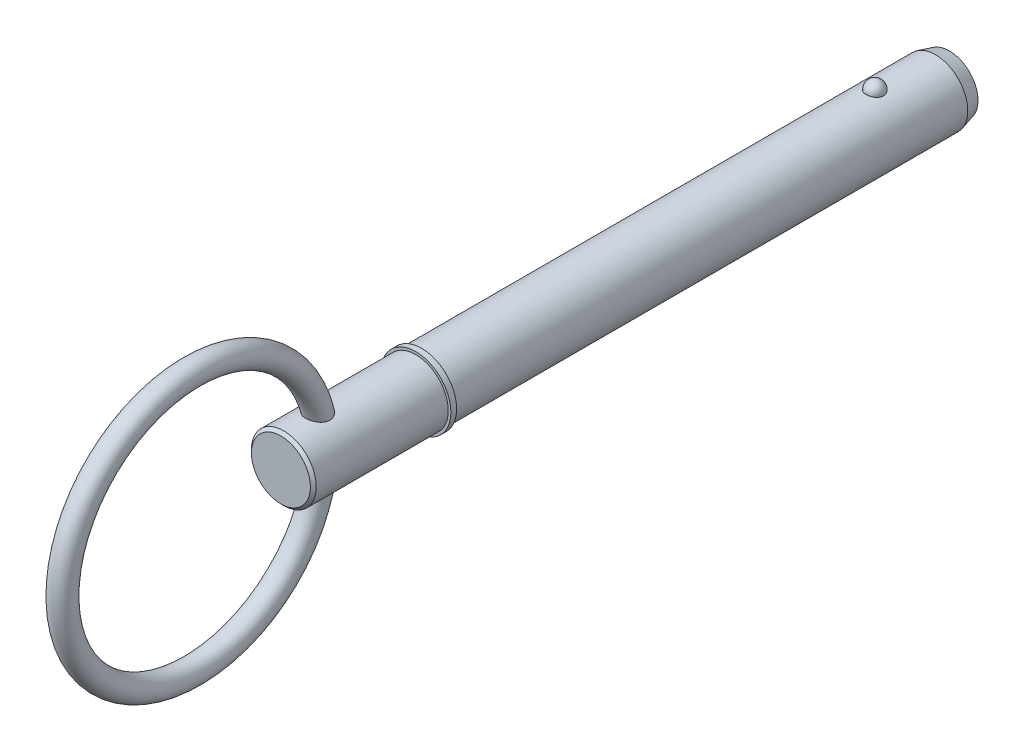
ISO-10303-21;
HEADER;
FILE_DESCRIPTION(('STEP AP214'),'2;1');
FILE_NAME('part.step','',(''),(''),'','','');
FILE_SCHEMA(('AUTOMOTIVE_DESIGN { 1 0 10303 214 1 1 1 1 }'));
ENDSEC;
DATA;
#1=APPLICATION_CONTEXT('core data for automotive mechanical design processes');
#2=APPLICATION_PROTOCOL_DEFINITION('international standard','automotive_design',2000,#1);
#3=PRODUCT_CONTEXT('',#1,'mechanical');
#4=PRODUCT('Part','Part','',(#3));
#5=PRODUCT_RELATED_PRODUCT_CATEGORY('part','',(#4));
#6=PRODUCT_DEFINITION_FORMATION('','',#4);
#7=PRODUCT_DEFINITION_CONTEXT('part definition',#1,'design');
#8=PRODUCT_DEFINITION('design','',#6,#7);
#9=PRODUCT_DEFINITION_SHAPE('','',#8);
#10=(LENGTH_UNIT() NAMED_UNIT(*) SI_UNIT(.MILLI.,.METRE.));
#11=(NAMED_UNIT(*) PLANE_ANGLE_UNIT() SI_UNIT($,.RADIAN.));
#12=(NAMED_UNIT(*) SI_UNIT($,.STERADIAN.) SOLID_ANGLE_UNIT());
#13=UNCERTAINTY_MEASURE_WITH_UNIT(LENGTH_MEASURE(1.E-05),#10,'distance_accuracy_value','');
#14=(GEOMETRIC_REPRESENTATION_CONTEXT(3) GLOBAL_UNCERTAINTY_ASSIGNED_CONTEXT((#13)) GLOBAL_UNIT_ASSIGNED_CONTEXT((#10,
#11,#12)) REPRESENTATION_CONTEXT('',''));
#15=CARTESIAN_POINT('',(0.,0.,0.));
#16=DIRECTION('',(0.,0.,1.));
#17=DIRECTION('',(1.,0.,0.));
#18=AXIS2_PLACEMENT_3D('',#15,#16,#17);
#19=CARTESIAN_POINT('',(0.,0.,76.2));
#20=DIRECTION('',(0.,0.,-1.));
#21=DIRECTION('',(-1.,0.,0.));
#22=AXIS2_PLACEMENT_3D('',#19,#20,#21);
#23=CYLINDRICAL_SURFACE('',#22,5.555);
#24=CARTESIAN_POINT('',(1.47653932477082,5.35517101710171,-1.49));
#25=CARTESIAN_POINT('',(1.4765376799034,5.35517235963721,-1.40667872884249));
#26=CARTESIAN_POINT('',(1.4697233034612,5.35706459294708,-1.32333626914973));
#27=CARTESIAN_POINT('',(1.4426291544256,5.36442332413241,-1.15900769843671));
#28=CARTESIAN_POINT('',(1.42234344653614,5.36989139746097,-1.07802264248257));
#29=CARTESIAN_POINT('',(1.36882802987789,5.38378061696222,-0.920757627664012));
#30=CARTESIAN_POINT('',(1.33560404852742,5.39220045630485,-0.844475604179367));
#31=CARTESIAN_POINT('',(1.25704906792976,5.41105136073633,-0.698703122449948));
#32=CARTESIAN_POINT('',(1.21171855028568,5.42148234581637,-0.629212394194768));
#33=CARTESIAN_POINT('',(1.10986325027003,5.44324765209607,-0.498626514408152));
#34=CARTESIAN_POINT('',(1.05328868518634,5.45458585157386,-0.437570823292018));
#35=CARTESIAN_POINT('',(0.930545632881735,5.4768596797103,-0.325918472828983));
#36=CARTESIAN_POINT('',(0.864377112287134,5.48779530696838,-0.27532184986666));
#37=CARTESIAN_POINT('',(0.72441282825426,5.50801510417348,-0.186125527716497));
#38=CARTESIAN_POINT('',(0.650637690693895,5.51730356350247,-0.147494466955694));
#39=CARTESIAN_POINT('',(0.497383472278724,5.53322345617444,-0.0831582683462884));
#40=CARTESIAN_POINT('',(0.417904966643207,5.53985515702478,-0.0574518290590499));
#41=CARTESIAN_POINT('',(0.256903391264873,5.54963245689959,-0.0200294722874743));
#42=CARTESIAN_POINT('',(0.175435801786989,5.55283384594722,-0.00808940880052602));
#43=CARTESIAN_POINT('',(0.0115885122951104,5.55559187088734,0.00221439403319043));
#44=CARTESIAN_POINT('',(-0.0707911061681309,5.55514883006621,0.000579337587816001));
#45=CARTESIAN_POINT('',(-0.232980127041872,5.55069756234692,-0.0161051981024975));
#46=CARTESIAN_POINT('',(-0.312809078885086,5.54673626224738,-0.0309781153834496));
#47=CARTESIAN_POINT('',(-0.468771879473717,5.5357377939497,-0.0734743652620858));
#48=CARTESIAN_POINT('',(-0.544905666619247,5.52870057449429,-0.101097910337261));
#49=CARTESIAN_POINT('',(-0.691800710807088,5.51225307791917,-0.168516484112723));
#50=CARTESIAN_POINT('',(-0.762530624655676,5.50283015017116,-0.208376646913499));
#51=CARTESIAN_POINT('',(-0.896294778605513,5.48263289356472,-0.299136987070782));
#52=CARTESIAN_POINT('',(-0.959328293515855,5.47185843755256,-0.350038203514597));
#53=CARTESIAN_POINT('',(-1.0771278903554,5.44990641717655,-0.462517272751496));
#54=CARTESIAN_POINT('',(-1.13172901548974,5.43872509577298,-0.524267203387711));
#55=CARTESIAN_POINT('',(-1.2299173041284,5.41736658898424,-0.656133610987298));
#56=CARTESIAN_POINT('',(-1.2735037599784,5.40718946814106,-0.726250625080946));
#57=CARTESIAN_POINT('',(-1.34896420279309,5.38886361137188,-0.873713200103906));
#58=CARTESIAN_POINT('',(-1.38071142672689,5.38073711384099,-0.951126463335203));
#59=CARTESIAN_POINT('',(-1.4310375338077,5.36757288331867,-1.11037033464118));
#60=CARTESIAN_POINT('',(-1.44961676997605,5.3625350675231,-1.19220082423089));
#61=CARTESIAN_POINT('',(-1.47308754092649,5.35613553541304,-1.35761209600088));
#62=CARTESIAN_POINT('',(-1.47803294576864,5.35475935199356,-1.44118467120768));
#63=CARTESIAN_POINT('',(-1.47426441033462,5.35579807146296,-1.6079958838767));
#64=CARTESIAN_POINT('',(-1.46555080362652,5.35821288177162,-1.69123452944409));
#65=CARTESIAN_POINT('',(-1.43475662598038,5.36653964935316,-1.8546288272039));
#66=CARTESIAN_POINT('',(-1.41273621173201,5.37243586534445,-1.93479663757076));
#67=CARTESIAN_POINT('',(-1.35593151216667,5.38705199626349,-2.0902011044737));
#68=CARTESIAN_POINT('',(-1.32114675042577,5.39577201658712,-2.16543757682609));
#69=CARTESIAN_POINT('',(-1.23947506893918,5.41511674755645,-2.30926926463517));
#70=CARTESIAN_POINT('',(-1.1925277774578,5.42575087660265,-2.37782893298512));
#71=CARTESIAN_POINT('',(-1.08780725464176,5.44771095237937,-2.50598876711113));
#72=CARTESIAN_POINT('',(-1.03003365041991,5.45903692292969,-2.56558862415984));
#73=CARTESIAN_POINT('',(-0.904953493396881,5.48116073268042,-2.67436535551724));
#74=CARTESIAN_POINT('',(-0.837616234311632,5.49195671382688,-2.7235073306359));
#75=CARTESIAN_POINT('',(-0.695379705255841,5.51177099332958,-2.8097317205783));
#76=CARTESIAN_POINT('',(-0.620480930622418,5.52078940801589,-2.84681492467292));
#77=CARTESIAN_POINT('',(-0.466144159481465,5.53594369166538,-2.90749751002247));
#78=CARTESIAN_POINT('',(-0.386768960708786,5.54211181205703,-2.93124844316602));
#79=CARTESIAN_POINT('',(-0.224991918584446,5.5510324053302,-2.96523308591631));
#80=CARTESIAN_POINT('',(-0.142590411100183,5.55378525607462,-2.97546829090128));
#81=CARTESIAN_POINT('',(0.0213711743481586,5.55555351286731,-2.98206550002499));
#82=CARTESIAN_POINT('',(0.102921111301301,5.55463281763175,-2.97866468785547));
#83=CARTESIAN_POINT('',(0.2642564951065,5.54929804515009,-2.95862186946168));
#84=CARTESIAN_POINT('',(0.344041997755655,5.54488407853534,-2.94198028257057));
#85=CARTESIAN_POINT('',(0.499344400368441,5.53305794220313,-2.89600357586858));
#86=CARTESIAN_POINT('',(0.57487425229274,5.52565550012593,-2.86670961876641));
#87=CARTESIAN_POINT('',(0.71989857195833,5.50863937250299,-2.79624249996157));
#88=CARTESIAN_POINT('',(0.78939269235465,5.49902555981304,-2.75506865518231));
#89=CARTESIAN_POINT('',(0.921480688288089,5.47845199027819,-2.66127110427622));
#90=CARTESIAN_POINT('',(0.983960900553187,5.46747485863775,-2.60849118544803));
#91=CARTESIAN_POINT('',(1.09925057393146,5.44546837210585,-2.49325304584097));
#92=CARTESIAN_POINT('',(1.15205830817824,5.43443900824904,-2.43079310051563));
#93=CARTESIAN_POINT('',(1.24742943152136,5.41335152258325,-2.29680711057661));
#94=CARTESIAN_POINT('',(1.28981661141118,5.40331162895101,-2.22515272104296));
#95=CARTESIAN_POINT('',(1.36214937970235,5.38553336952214,-2.07558035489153));
#96=CARTESIAN_POINT('',(1.39210034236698,5.37779400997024,-1.99766510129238));
#97=CARTESIAN_POINT('',(1.43569518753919,5.36630594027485,-1.84848338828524));
#98=CARTESIAN_POINT('',(1.45098536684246,5.36216169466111,-1.77772322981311));
#99=CARTESIAN_POINT('',(1.47140805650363,5.35659367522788,-1.63464735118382));
#100=CARTESIAN_POINT('',(1.47654075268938,5.35516985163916,-1.56233165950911));
#101=CARTESIAN_POINT('',(1.47653932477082,5.35517101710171,-1.49));
#102=B_SPLINE_CURVE_WITH_KNOTS('',3,(#24,#25,#26,#27,#28,#29,#30,#31,#32,#33,#34,#35,#36,#37,
#38,#39,#40,#41,#42,#43,#44,#45,#46,#47,#48,#49,#50,#51,#52,#53,#54,#55,#56,#57,#58,#59,#60,#61,
#62,#63,#64,#65,#66,#67,#68,#69,#70,#71,#72,#73,#74,#75,#76,#77,#78,#79,#80,#81,#82,#83,#84,#85,
#86,#87,#88,#89,#90,#91,#92,#93,#94,#95,#96,#97,#98,#99,#100,#101),.UNSPECIFIED.,.T.,.F.,(4,2,2,
2,2,2,2,2,2,2,2,2,2,2,2,2,2,2,2,2,2,2,2,2,2,2,2,2,2,2,2,2,2,2,2,2,2,2,4),(0.,0.249703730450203,
0.4995175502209,0.749220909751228,0.998914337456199,1.24973894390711,1.50056442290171,
1.75072681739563,2.00086401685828,2.24686822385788,2.49285060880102,2.73560052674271,
2.97835449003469,3.22242369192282,3.46651587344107,3.71490232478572,3.96330473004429,
4.21429522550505,4.46527899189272,4.71526963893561,4.96525418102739,5.21411697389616,
5.46298905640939,5.71312097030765,5.96326150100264,6.21422412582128,6.46517032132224,
6.71320296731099,6.96120816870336,7.20491846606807,7.44862104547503,7.69153667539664,
7.93446627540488,8.18089104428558,8.42735976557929,8.67774679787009,8.92802551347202,
9.14479867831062,9.36156787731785),.UNSPECIFIED.);
#103=CARTESIAN_POINT('',(1.47653932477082,5.35517101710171,-1.49));
#104=VERTEX_POINT('',#103);
#105=EDGE_CURVE('E100',#104,#104,#102,.T.);
#106=ORIENTED_EDGE('',*,*,#105,.T.);
#107=EDGE_LOOP('',(#106));
#108=FACE_BOUND('',#107,.T.);
#109=CARTESIAN_POINT('',(0.,0.,-11.87));
#110=DIRECTION('',(0.,0.,-1.));
#111=DIRECTION('',(-1.,0.,0.));
#112=AXIS2_PLACEMENT_3D('',#109,#110,#111);
#113=CIRCLE('',#112,5.555);
#114=CARTESIAN_POINT('',(-5.555,0.,-11.87));
#115=VERTEX_POINT('',#114);
#116=EDGE_CURVE('E107',#115,#115,#113,.F.);
#117=ORIENTED_EDGE('',*,*,#116,.T.);
#118=EDGE_LOOP('',(#117));
#119=FACE_BOUND('',#118,.T.);
#120=CARTESIAN_POINT('',(0.,0.,76.2));
#121=DIRECTION('',(0.,0.,1.));
#122=DIRECTION('',(1.,0.,0.));
#123=AXIS2_PLACEMENT_3D('',#120,#121,#122);
#124=CIRCLE('',#123,5.555);
#125=CARTESIAN_POINT('',(5.555,0.,76.2));
#126=VERTEX_POINT('',#125);
#127=EDGE_CURVE('E105',#126,#126,#124,.T.);
#128=ORIENTED_EDGE('',*,*,#127,.F.);
#129=EDGE_LOOP('',(#128));
#130=FACE_BOUND('',#129,.T.);
#131=ADVANCED_FACE('F39',(#108,#119,#130),#23,.T.);
#132=CARTESIAN_POINT('',(0.,0.,-14.27));
#133=DIRECTION('',(0.,0.,-1.));
#134=DIRECTION('',(-1.,0.,0.));
#135=AXIS2_PLACEMENT_3D('',#132,#133,#134);
#136=PLANE('',#135);
#137=CARTESIAN_POINT('',(0.,0.,-14.27));
#138=DIRECTION('',(0.,0.,-1.));
#139=DIRECTION('',(-1.,0.,0.));
#140=AXIS2_PLACEMENT_3D('',#137,#138,#139);
#141=CIRCLE('',#140,4.91192193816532);
#142=CARTESIAN_POINT('',(-4.91192193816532,0.,-14.27));
#143=VERTEX_POINT('',#142);
#144=EDGE_CURVE('E141',#143,#143,#141,.T.);
#145=ORIENTED_EDGE('',*,*,#144,.T.);
#146=EDGE_LOOP('',(#145));
#147=FACE_BOUND('',#146,.T.);
#148=ADVANCED_FACE('F86',(#147),#136,.T.);
#149=CARTESIAN_POINT('',(0.,0.,-14.27));
#150=DIRECTION('',(0.,0.,1.));
#151=DIRECTION('',(1.,0.,0.));
#152=AXIS2_PLACEMENT_3D('',#149,#150,#151);
#153=CONICAL_SURFACE('',#152,4.91192193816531,0.26179938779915);
#154=ORIENTED_EDGE('',*,*,#116,.F.);
#155=EDGE_LOOP('',(#154));
#156=FACE_BOUND('',#155,.T.);
#157=ORIENTED_EDGE('',*,*,#144,.F.);
#158=EDGE_LOOP('',(#157));
#159=FACE_BOUND('',#158,.T.);
#160=ADVANCED_FACE('F92',(#156,#159),#153,.T.);
#161=CARTESIAN_POINT('',(0.,5.555,-1.49));
#162=DIRECTION('',(0.,1.,0.));
#163=DIRECTION('',(0.,0.,1.));
#164=AXIS2_PLACEMENT_3D('',#161,#162,#163);
#165=SPHERICAL_SURFACE('',#164,1.49);
#166=ORIENTED_EDGE('',*,*,#105,.F.);
#167=EDGE_LOOP('',(#166));
#168=FACE_BOUND('',#167,.T.);
#169=ADVANCED_FACE('F110',(#168),#165,.T.);
#170=CARTESIAN_POINT('',(0.,0.,76.2));
#171=DIRECTION('',(0.,0.,-1.));
#172=DIRECTION('',(-1.,0.,0.));
#173=AXIS2_PLACEMENT_3D('',#170,#171,#172);
#174=PLANE('',#173);
#175=ORIENTED_EDGE('',*,*,#127,.T.);
#176=EDGE_LOOP('',(#175));
#177=FACE_BOUND('',#176,.T.);
#178=CARTESIAN_POINT('',(0.,0.,76.2));
#179=DIRECTION('',(0.,0.,-1.));
#180=DIRECTION('',(-1.,0.,0.));
#181=AXIS2_PLACEMENT_3D('',#178,#179,#180);
#182=CIRCLE('',#181,6.);
#183=CARTESIAN_POINT('',(-6.,0.,76.2));
#184=VERTEX_POINT('',#183);
#185=EDGE_CURVE('E106',#184,#184,#182,.T.);
#186=ORIENTED_EDGE('',*,*,#185,.T.);
#187=EDGE_LOOP('',(#186));
#188=FACE_BOUND('',#187,.T.);
#189=ADVANCED_FACE('F114',(#177,#188),#174,.T.);
#190=CARTESIAN_POINT('',(0.,0.,33.7287874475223));
#191=DIRECTION('',(0.,0.,-1.));
#192=DIRECTION('',(-1.,0.,0.));
#193=AXIS2_PLACEMENT_3D('',#190,#191,#192);
#194=CYLINDRICAL_SURFACE('',#193,6.);
#195=CARTESIAN_POINT('',(0.,0.,77.2));
#196=DIRECTION('',(0.,0.,-1.));
#197=DIRECTION('',(-1.,0.,0.));
#198=AXIS2_PLACEMENT_3D('',#195,#196,#197);
#199=CIRCLE('',#198,6.);
#200=CARTESIAN_POINT('',(-6.,0.,77.2));
#201=VERTEX_POINT('',#200);
#202=EDGE_CURVE('E131',#201,#201,#199,.T.);
#203=ORIENTED_EDGE('',*,*,#202,.T.);
#204=EDGE_LOOP('',(#203));
#205=FACE_BOUND('',#204,.T.);
#206=ORIENTED_EDGE('',*,*,#185,.F.);
#207=EDGE_LOOP('',(#206));
#208=FACE_BOUND('',#207,.T.);
#209=ADVANCED_FACE('F118',(#205,#208),#194,.T.);
#210=CARTESIAN_POINT('',(0.,6.,77.2));
#211=DIRECTION('',(0.,0.,1.));
#212=DIRECTION('',(1.,0.,0.));
#213=AXIS2_PLACEMENT_3D('',#210,#211,#212);
#214=PLANE('',#213);
#215=CARTESIAN_POINT('',(0.,0.,77.2));
#216=DIRECTION('',(0.,0.,1.));
#217=DIRECTION('',(1.,0.,0.));
#218=AXIS2_PLACEMENT_3D('',#215,#216,#217);
#219=CIRCLE('',#218,5.555);
#220=CARTESIAN_POINT('',(5.555,0.,77.2));
#221=VERTEX_POINT('',#220);
#222=EDGE_CURVE('E109',#221,#221,#219,.T.);
#223=ORIENTED_EDGE('',*,*,#222,.F.);
#224=EDGE_LOOP('',(#223));
#225=FACE_BOUND('',#224,.T.);
#226=ORIENTED_EDGE('',*,*,#202,.F.);
#227=EDGE_LOOP('',(#226));
#228=FACE_BOUND('',#227,.T.);
#229=ADVANCED_FACE('F83',(#225,#228),#214,.T.);
#230=CARTESIAN_POINT('',(0.,0.,100.33));
#231=DIRECTION('',(0.,0.,-1.));
#232=DIRECTION('',(-1.,0.,0.));
#233=AXIS2_PLACEMENT_3D('',#230,#231,#232);
#234=CYLINDRICAL_SURFACE('',#233,5.555);
#235=CARTESIAN_POINT('',(-0.961380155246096,-5.47117658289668,92.2087332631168));
#236=CARTESIAN_POINT('',(-0.863231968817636,-5.48842171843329,92.1575155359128));
#237=CARTESIAN_POINT('',(-0.7605484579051,-5.50372118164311,92.1143181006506));
#238=CARTESIAN_POINT('',(-0.548956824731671,-5.52883500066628,92.0449127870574));
#239=CARTESIAN_POINT('',(-0.440048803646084,-5.53864944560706,92.0187046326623));
#240=CARTESIAN_POINT('',(-0.219033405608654,-5.55178384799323,91.9838646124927));
#241=CARTESIAN_POINT('',(-0.106925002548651,-5.55510169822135,91.9752384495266));
#242=CARTESIAN_POINT('',(0.11723899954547,-5.55489351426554,91.9757834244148));
#243=CARTESIAN_POINT('',(0.229294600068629,-5.55136768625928,91.9849540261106));
#244=CARTESIAN_POINT('',(0.449588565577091,-5.5378711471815,92.0207847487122));
#245=CARTESIAN_POINT('',(0.557843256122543,-5.52793284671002,92.047356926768));
#246=CARTESIAN_POINT('',(0.768116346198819,-5.50265785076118,92.1173095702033));
#247=CARTESIAN_POINT('',(0.87013418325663,-5.48732066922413,92.1606915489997));
#248=CARTESIAN_POINT('',(1.06580880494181,-5.45270790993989,92.2636854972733));
#249=CARTESIAN_POINT('',(1.1594033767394,-5.43340601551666,92.3234068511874));
#250=CARTESIAN_POINT('',(1.33484934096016,-5.39298781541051,92.4576727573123));
#251=CARTESIAN_POINT('',(1.41670019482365,-5.37187142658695,92.5322179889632));
#252=CARTESIAN_POINT('',(1.5662865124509,-5.33017932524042,92.6944337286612));
#253=CARTESIAN_POINT('',(1.63402728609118,-5.30960341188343,92.7820992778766));
#254=CARTESIAN_POINT('',(1.75338323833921,-5.27139606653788,92.96835593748));
#255=CARTESIAN_POINT('',(1.80500413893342,-5.25376359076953,93.0669431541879));
#256=CARTESIAN_POINT('',(1.88923054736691,-5.22405733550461,93.2688661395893));
#257=CARTESIAN_POINT('',(1.92240068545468,-5.21182119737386,93.3719426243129));
#258=CARTESIAN_POINT('',(1.97156802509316,-5.19342304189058,93.5826121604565));
#259=CARTESIAN_POINT('',(1.98756752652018,-5.18726021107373,93.6902046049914));
#260=CARTESIAN_POINT('',(2.00238957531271,-5.1815556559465,93.9048133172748));
#261=CARTESIAN_POINT('',(2.0015062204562,-5.18190056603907,94.0118070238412));
#262=CARTESIAN_POINT('',(1.98404322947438,-5.18861029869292,94.2242949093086));
#263=CARTESIAN_POINT('',(1.96745884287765,-5.19497694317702,94.32978862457));
#264=CARTESIAN_POINT('',(1.91810947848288,-5.21340722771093,94.5437346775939));
#265=CARTESIAN_POINT('',(1.88435438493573,-5.22581720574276,94.6519270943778));
#266=CARTESIAN_POINT('',(1.80161540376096,-5.25491400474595,94.8617187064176));
#267=CARTESIAN_POINT('',(1.75262312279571,-5.27160318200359,94.9633142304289));
#268=CARTESIAN_POINT('',(1.63431251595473,-5.30955034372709,95.1688565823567));
#269=CARTESIAN_POINT('',(1.56333412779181,-5.33111051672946,95.2717964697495));
#270=CARTESIAN_POINT('',(1.40529607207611,-5.37493145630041,95.4644716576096));
#271=CARTESIAN_POINT('',(1.31822569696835,-5.39719268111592,95.5541980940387));
#272=CARTESIAN_POINT('',(1.12728892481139,-5.44031451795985,95.7190042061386));
#273=CARTESIAN_POINT('',(1.02309899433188,-5.46113424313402,95.793723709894));
#274=CARTESIAN_POINT('',(0.801576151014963,-5.49800171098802,95.9218052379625));
#275=CARTESIAN_POINT('',(0.684264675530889,-5.51405708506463,95.975201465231));
#276=CARTESIAN_POINT('',(0.456877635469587,-5.53719478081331,96.050980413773));
#277=CARTESIAN_POINT('',(0.34797457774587,-5.54519800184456,96.0765844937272));
#278=CARTESIAN_POINT('',(0.12704223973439,-5.55464249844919,96.1067313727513));
#279=CARTESIAN_POINT('',(0.0150164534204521,-5.55609083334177,96.111296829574));
#280=CARTESIAN_POINT('',(-0.191993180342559,-5.55250986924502,96.0999113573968));
#281=CARTESIAN_POINT('',(-0.287160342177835,-5.54836194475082,96.0867524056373));
#282=CARTESIAN_POINT('',(-0.473863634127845,-5.53554271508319,96.0454897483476));
#283=CARTESIAN_POINT('',(-0.565399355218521,-5.52687090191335,96.0173843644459));
#284=CARTESIAN_POINT('',(-0.743786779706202,-5.50572322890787,95.947293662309));
#285=CARTESIAN_POINT('',(-0.830566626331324,-5.49320168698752,95.9051411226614));
#286=CARTESIAN_POINT('',(-0.996720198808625,-5.46549909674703,95.808875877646));
#287=CARTESIAN_POINT('',(-1.07609119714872,-5.45031707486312,95.7547587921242));
#288=CARTESIAN_POINT('',(-1.23672272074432,-5.41628785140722,95.6282113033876));
#289=CARTESIAN_POINT('',(-1.3167603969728,-5.39722327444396,95.5542891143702));
#290=CARTESIAN_POINT('',(-1.46504263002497,-5.3588760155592,95.395462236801));
#291=CARTESIAN_POINT('',(-1.53327828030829,-5.33959318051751,95.3105493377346));
#292=CARTESIAN_POINT('',(-1.6660227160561,-5.29979878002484,95.1186972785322));
#293=CARTESIAN_POINT('',(-1.72857256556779,-5.27951148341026,95.0103478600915));
#294=CARTESIAN_POINT('',(-1.83559571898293,-5.24326402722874,94.7843258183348));
#295=CARTESIAN_POINT('',(-1.88006296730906,-5.22730531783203,94.6666500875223));
#296=CARTESIAN_POINT('',(-1.94988009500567,-5.20167534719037,94.4220877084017));
#297=CARTESIAN_POINT('',(-1.97477410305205,-5.19215470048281,94.2950527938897));
#298=CARTESIAN_POINT('',(-2.00168294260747,-5.18184594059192,94.0382494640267));
#299=CARTESIAN_POINT('',(-2.0037221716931,-5.18104851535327,93.9084841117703));
#300=CARTESIAN_POINT('',(-1.98467753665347,-5.18836681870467,93.6646529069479));
#301=CARTESIAN_POINT('',(-1.96600067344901,-5.19555485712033,93.5503700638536));
#302=CARTESIAN_POINT('',(-1.90923541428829,-5.21668050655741,93.327389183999));
#303=CARTESIAN_POINT('',(-1.87115335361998,-5.23061591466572,93.2186893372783));
#304=CARTESIAN_POINT('',(-1.78015350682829,-5.26224244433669,93.0183712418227));
#305=CARTESIAN_POINT('',(-1.72857344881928,-5.27957041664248,92.9260829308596));
#306=CARTESIAN_POINT('',(-1.61106729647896,-5.31660340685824,92.7516847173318));
#307=CARTESIAN_POINT('',(-1.54514024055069,-5.33630858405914,92.6695754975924));
#308=CARTESIAN_POINT('',(-1.39929408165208,-5.37641320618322,92.5158871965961));
#309=CARTESIAN_POINT('',(-1.31912544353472,-5.39681868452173,92.4445467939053));
#310=CARTESIAN_POINT('',(-1.14786008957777,-5.43582099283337,92.3158557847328));
#311=CARTESIAN_POINT('',(-1.05676174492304,-5.4544175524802,92.2585072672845));
#312=CARTESIAN_POINT('',(-0.961380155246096,-5.47117658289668,92.2087332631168));
#313=B_SPLINE_CURVE_WITH_KNOTS('',3,(#235,#236,#237,#238,#239,#240,#241,#242,#243,#244,#245,
#246,#247,#248,#249,#250,#251,#252,#253,#254,#255,#256,#257,#258,#259,#260,#261,#262,#263,#264,
#265,#266,#267,#268,#269,#270,#271,#272,#273,#274,#275,#276,#277,#278,#279,#280,#281,#282,#283,
#284,#285,#286,#287,#288,#289,#290,#291,#292,#293,#294,#295,#296,#297,#298,#299,#300,#301,#302,
#303,#304,#305,#306,#307,#308,#309,#310,#311,#312),.UNSPECIFIED.,.T.,.F.,(4,2,2,2,2,2,2,2,2,2,2,
2,2,2,2,2,2,2,2,2,2,2,2,2,2,2,2,2,2,2,2,2,2,2,2,2,2,2,4),(0.,0.335747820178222,0.67149018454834,
1.0073414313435,1.3431825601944,1.6773394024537,2.01152633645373,2.3480076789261,
2.68450444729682,3.020874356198,3.35712472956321,3.68242216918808,4.0076760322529,
4.32726924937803,4.6469591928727,4.98762165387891,5.32847210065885,5.7074287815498,
6.08663853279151,6.47407889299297,6.86089527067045,7.19531213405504,7.52936875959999,
7.81649827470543,8.10366003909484,8.39437023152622,8.68518702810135,9.01572837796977,
9.34651809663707,9.72504519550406,10.1036989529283,10.4909301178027,10.8777478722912,
11.2239231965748,11.5699855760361,11.8899109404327,12.2098577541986,12.5360928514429,
12.8623766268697),.UNSPECIFIED.);
#314=CARTESIAN_POINT('',(-0.961380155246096,-5.47117658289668,92.2087332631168));
#315=VERTEX_POINT('',#314);
#316=EDGE_CURVE('E10',#315,#315,#313,.T.);
#317=ORIENTED_EDGE('',*,*,#316,.F.);
#318=EDGE_LOOP('',(#317));
#319=FACE_BOUND('',#318,.T.);
#320=CARTESIAN_POINT('',(-0.961380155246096,5.47117658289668,92.2087332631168));
#321=CARTESIAN_POINT('',(-1.05891474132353,5.45403910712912,92.2596311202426));
#322=CARTESIAN_POINT('',(-1.15197270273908,5.43497920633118,92.3184510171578));
#323=CARTESIAN_POINT('',(-1.32661268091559,5.39501222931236,92.4507016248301));
#324=CARTESIAN_POINT('',(-1.40819495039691,5.37410519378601,92.5241320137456));
#325=CARTESIAN_POINT('',(-1.55769110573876,5.33269731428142,92.684098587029));
#326=CARTESIAN_POINT('',(-1.62558729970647,5.3121970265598,92.7706514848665));
#327=CARTESIAN_POINT('',(-1.74556031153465,5.27399510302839,92.9546466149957));
#328=CARTESIAN_POINT('',(-1.7976419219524,5.25629262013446,93.0520855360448));
#329=CARTESIAN_POINT('',(-1.88339939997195,5.22617061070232,93.2525656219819));
#330=CARTESIAN_POINT('',(-1.91750373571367,5.21362983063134,93.3554052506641));
#331=CARTESIAN_POINT('',(-1.96852412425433,5.194582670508,93.5657781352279));
#332=CARTESIAN_POINT('',(-1.98544249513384,5.18807547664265,93.6733107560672));
#333=CARTESIAN_POINT('',(-2.00201964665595,5.18170011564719,93.8878197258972));
#334=CARTESIAN_POINT('',(-2.00199605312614,5.18170977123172,93.994768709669));
#335=CARTESIAN_POINT('',(-1.98621575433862,5.18777751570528,94.2073062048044));
#336=CARTESIAN_POINT('',(-1.97045441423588,5.19383738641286,94.3128943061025));
#337=CARTESIAN_POINT('',(-1.92280904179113,5.21167084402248,94.5269141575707));
#338=CARTESIAN_POINT('',(-1.88996782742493,5.22378174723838,94.6351030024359));
#339=CARTESIAN_POINT('',(-1.8090690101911,5.252344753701,94.845029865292));
#340=CARTESIAN_POINT('',(-1.76100319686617,5.26879919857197,94.946764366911));
#341=CARTESIAN_POINT('',(-1.64464870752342,5.30634509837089,95.1527880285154));
#342=CARTESIAN_POINT('',(-1.57469702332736,5.32774959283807,95.2560850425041));
#343=CARTESIAN_POINT('',(-1.41872356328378,5.37138743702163,95.4496881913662));
#344=CARTESIAN_POINT('',(-1.3326906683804,5.39362135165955,95.5399852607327));
#345=CARTESIAN_POINT('',(-1.14345202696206,5.43692909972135,95.7065572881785));
#346=CARTESIAN_POINT('',(-1.03986000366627,5.45795811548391,95.7824096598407));
#347=CARTESIAN_POINT('',(-0.819338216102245,5.49537389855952,95.9129167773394));
#348=CARTESIAN_POINT('',(-0.70242947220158,5.51176784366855,95.9676043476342));
#349=CARTESIAN_POINT('',(-0.475167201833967,5.53565843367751,96.0460220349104));
#350=CARTESIAN_POINT('',(-0.365997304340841,5.54404610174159,96.0728937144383));
#351=CARTESIAN_POINT('',(-0.144272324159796,5.55422966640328,96.1054265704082));
#352=CARTESIAN_POINT('',(-0.031721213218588,5.55603301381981,96.1111117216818));
#353=CARTESIAN_POINT('',(0.176166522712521,5.55303883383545,96.1015929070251));
#354=CARTESIAN_POINT('',(0.271662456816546,5.54914868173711,96.0892608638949));
#355=CARTESIAN_POINT('',(0.459140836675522,5.53678955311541,96.0495233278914));
#356=CARTESIAN_POINT('',(0.551122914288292,5.52832009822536,96.022116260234));
#357=CARTESIAN_POINT('',(0.730082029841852,5.50755841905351,95.9534371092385));
#358=CARTESIAN_POINT('',(0.817013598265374,5.49523641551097,95.9120568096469));
#359=CARTESIAN_POINT('',(0.98356924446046,5.46788364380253,95.8172936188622));
#360=CARTESIAN_POINT('',(1.06319070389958,5.45285191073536,95.7639064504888));
#361=CARTESIAN_POINT('',(1.22430017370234,5.4191117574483,95.6389828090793));
#362=CARTESIAN_POINT('',(1.30459540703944,5.40018081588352,95.5659703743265));
#363=CARTESIAN_POINT('',(1.45353150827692,5.3620139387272,95.4089433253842));
#364=CARTESIAN_POINT('',(1.52216366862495,5.3427777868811,95.3249205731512));
#365=CARTESIAN_POINT('',(1.65601602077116,5.30294271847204,95.1348114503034));
#366=CARTESIAN_POINT('',(1.71927851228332,5.28255425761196,95.0272944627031));
#367=CARTESIAN_POINT('',(1.82790996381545,5.24595721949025,94.8028474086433));
#368=CARTESIAN_POINT('',(1.8732722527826,5.22975020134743,94.6859138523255));
#369=CARTESIAN_POINT('',(1.94526503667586,5.20341207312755,94.4421941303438));
#370=CARTESIAN_POINT('',(1.97135787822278,5.1934564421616,94.3152273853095));
#371=CARTESIAN_POINT('',(2.00068973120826,5.18223330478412,94.058318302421));
#372=CARTESIAN_POINT('',(2.00395290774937,5.18095661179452,93.9283792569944));
#373=CARTESIAN_POINT('',(1.98717985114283,5.1874070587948,93.683763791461));
#374=CARTESIAN_POINT('',(1.96951989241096,5.19421607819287,93.5688994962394));
#375=CARTESIAN_POINT('',(1.91463360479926,5.2146960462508,93.3445890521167));
#376=CARTESIAN_POINT('',(1.87741409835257,5.22836460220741,93.2351410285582));
#377=CARTESIAN_POINT('',(1.78800305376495,5.25957304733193,93.0335428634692));
#378=CARTESIAN_POINT('',(1.73720600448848,5.27672774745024,92.9407093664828));
#379=CARTESIAN_POINT('',(1.62116201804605,5.3135255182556,92.7651218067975));
#380=CARTESIAN_POINT('',(1.55591428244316,5.33316872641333,92.6823683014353));
#381=CARTESIAN_POINT('',(1.41164041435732,5.37317145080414,92.5276485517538));
#382=CARTESIAN_POINT('',(1.33241957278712,5.39353732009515,92.4558657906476));
#383=CARTESIAN_POINT('',(1.16300716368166,5.43258596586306,92.3261126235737));
#384=CARTESIAN_POINT('',(1.07281393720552,5.45126848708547,92.2681443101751));
#385=CARTESIAN_POINT('',(0.880638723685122,5.48564753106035,92.1655070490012));
#386=CARTESIAN_POINT('',(0.77836470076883,5.50122427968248,92.1213437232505));
#387=CARTESIAN_POINT('',(0.567418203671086,5.52696543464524,92.0499735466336));
#388=CARTESIAN_POINT('',(0.458745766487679,5.53712987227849,92.0227665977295));
#389=CARTESIAN_POINT('',(0.23779150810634,5.55101406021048,91.9858797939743));
#390=CARTESIAN_POINT('',(0.12550171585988,5.55471842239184,91.9762417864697));
#391=CARTESIAN_POINT('',(-0.0992056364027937,5.55525045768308,91.9748490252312));
#392=CARTESIAN_POINT('',(-0.211623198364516,5.55207802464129,91.9830945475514));
#393=CARTESIAN_POINT('',(-0.43421780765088,5.53913427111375,92.017408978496));
#394=CARTESIAN_POINT('',(-0.544370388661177,5.52931142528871,92.0436170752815));
#395=CARTESIAN_POINT('',(-0.758352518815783,5.50404767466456,92.1133955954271));
#396=CARTESIAN_POINT('',(-0.862181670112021,5.48860641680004,92.1569671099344));
#397=CARTESIAN_POINT('',(-0.961380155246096,5.47117658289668,92.2087332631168));
#398=B_SPLINE_CURVE_WITH_KNOTS('',3,(#320,#321,#322,#323,#324,#325,#326,#327,#328,#329,#330,
#331,#332,#333,#334,#335,#336,#337,#338,#339,#340,#341,#342,#343,#344,#345,#346,#347,#348,#349,
#350,#351,#352,#353,#354,#355,#356,#357,#358,#359,#360,#361,#362,#363,#364,#365,#366,#367,#368,
#369,#370,#371,#372,#373,#374,#375,#376,#377,#378,#379,#380,#381,#382,#383,#384,#385,#386,#387,
#388,#389,#390,#391,#392,#393,#394,#395,#396,#397),.UNSPECIFIED.,.T.,.F.,(4,2,2,2,2,2,2,2,2,2,2,
2,2,2,2,2,2,2,2,2,2,2,2,2,2,2,2,2,2,2,2,2,2,2,2,2,2,2,4),(0.,0.333636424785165,
0.667265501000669,1.00132312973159,1.33527942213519,1.66086829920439,1.98641325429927,
2.30585509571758,2.62539104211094,2.96514840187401,3.30508930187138,3.68313901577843,
4.06145109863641,4.4495380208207,4.83702062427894,5.17316628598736,5.508931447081,
5.79666415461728,6.08442692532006,6.37447144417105,6.66461944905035,6.99384361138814,
7.32331250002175,7.70083591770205,8.07849989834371,8.46633986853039,8.85376924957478,
9.20110411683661,9.54831791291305,9.86844524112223,10.1885902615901,10.513611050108,
10.8386810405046,11.1745469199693,11.5104108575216,11.8470737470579,12.183741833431,
12.5230486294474,12.8623767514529),.UNSPECIFIED.);
#399=CARTESIAN_POINT('',(-0.961380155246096,5.47117658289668,92.2087332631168));
#400=VERTEX_POINT('',#399);
#401=EDGE_CURVE('E51',#400,#400,#398,.T.);
#402=ORIENTED_EDGE('',*,*,#401,.F.);
#403=EDGE_LOOP('',(#402));
#404=FACE_BOUND('',#403,.T.);
#405=CARTESIAN_POINT('',(0.,0.,99.83));
#406=DIRECTION('',(0.,0.,-1.));
#407=DIRECTION('',(-1.,0.,0.));
#408=AXIS2_PLACEMENT_3D('',#405,#406,#407);
#409=CIRCLE('',#408,5.555);
#410=CARTESIAN_POINT('',(-5.555,0.,99.83));
#411=VERTEX_POINT('',#410);
#412=EDGE_CURVE('E62',#411,#411,#409,.T.);
#413=ORIENTED_EDGE('',*,*,#412,.T.);
#414=EDGE_LOOP('',(#413));
#415=FACE_BOUND('',#414,.T.);
#416=ORIENTED_EDGE('',*,*,#222,.T.);
#417=EDGE_LOOP('',(#416));
#418=FACE_BOUND('',#417,.T.);
#419=ADVANCED_FACE('F67',(#319,#404,#415,#418),#234,.T.);
#420=CARTESIAN_POINT('',(0.,0.,100.33));
#421=DIRECTION('',(0.,0.,-1.));
#422=DIRECTION('',(-1.,0.,0.));
#423=AXIS2_PLACEMENT_3D('',#420,#421,#422);
#424=PLANE('',#423);
#425=CARTESIAN_POINT('',(0.,0.,100.33));
#426=DIRECTION('',(0.,0.,-1.));
#427=DIRECTION('',(-1.,0.,0.));
#428=AXIS2_PLACEMENT_3D('',#425,#426,#427);
#429=CIRCLE('',#428,5.05499999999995);
#430=CARTESIAN_POINT('',(-5.05499999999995,0.,100.33));
#431=VERTEX_POINT('',#430);
#432=EDGE_CURVE('E57',#431,#431,#429,.F.);
#433=ORIENTED_EDGE('',*,*,#432,.T.);
#434=EDGE_LOOP('',(#433));
#435=FACE_BOUND('',#434,.T.);
#436=ADVANCED_FACE('F74',(#435),#424,.F.);
#437=CARTESIAN_POINT('',(0.,0.,99.83));
#438=DIRECTION('',(0.,0.,-1.));
#439=DIRECTION('',(-1.,0.,0.));
#440=AXIS2_PLACEMENT_3D('',#437,#438,#439);
#441=CONICAL_SURFACE('',#440,5.555,0.78539816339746);
#442=ORIENTED_EDGE('',*,*,#432,.F.);
#443=EDGE_LOOP('',(#442));
#444=FACE_BOUND('',#443,.T.);
#445=ORIENTED_EDGE('',*,*,#412,.F.);
#446=EDGE_LOOP('',(#445));
#447=FACE_BOUND('',#446,.T.);
#448=ADVANCED_FACE('F41',(#444,#447),#441,.T.);
#449=CARTESIAN_POINT('',(0.,0.,115.555));
#450=DIRECTION('',(1.,0.,0.));
#451=DIRECTION('',(0.,0.,-1.));
#452=AXIS2_PLACEMENT_3D('',#449,#450,#451);
#453=TOROIDAL_SURFACE('',#452,22.225,2.);
#454=ORIENTED_EDGE('',*,*,#316,.T.);
#455=EDGE_LOOP('',(#454));
#456=FACE_BOUND('',#455,.T.);
#457=ORIENTED_EDGE('',*,*,#401,.T.);
#458=EDGE_LOOP('',(#457));
#459=FACE_BOUND('',#458,.T.);
#460=ADVANCED_FACE('F71',(#456,#459),#453,.T.);
#461=CLOSED_SHELL('',(#131,#148,#160,#169,#189,#209,#229,#419,#436,#448,#460));
#462=MANIFOLD_SOLID_BREP('B2',#461);
#463=ADVANCED_BREP_SHAPE_REPRESENTATION('',(#18,#462),#14);
#464=SHAPE_DEFINITION_REPRESENTATION(#9,#463);
ENDSEC;
END-ISO-10303-21;
